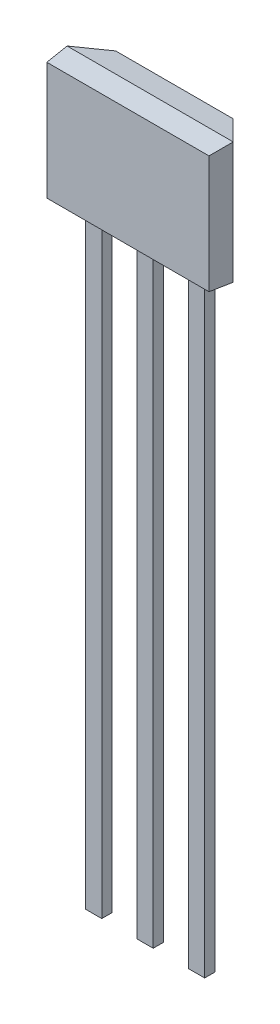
ISO-10303-21;
HEADER;
FILE_DESCRIPTION(('STEP AP214'),'2;1');
FILE_NAME('part.step','',(''),(''),'','','');
FILE_SCHEMA(('AUTOMOTIVE_DESIGN { 1 0 10303 214 1 1 1 1 }'));
ENDSEC;
DATA;
#1=APPLICATION_CONTEXT('core data for automotive mechanical design processes');
#2=APPLICATION_PROTOCOL_DEFINITION('international standard','automotive_design',2000,#1);
#3=PRODUCT_CONTEXT('',#1,'mechanical');
#4=PRODUCT('Part','Part','',(#3));
#5=PRODUCT_RELATED_PRODUCT_CATEGORY('part','',(#4));
#6=PRODUCT_DEFINITION_FORMATION('','',#4);
#7=PRODUCT_DEFINITION_CONTEXT('part definition',#1,'design');
#8=PRODUCT_DEFINITION('design','',#6,#7);
#9=PRODUCT_DEFINITION_SHAPE('','',#8);
#10=(LENGTH_UNIT() NAMED_UNIT(*) SI_UNIT(.MILLI.,.METRE.));
#11=(NAMED_UNIT(*) PLANE_ANGLE_UNIT() SI_UNIT($,.RADIAN.));
#12=(NAMED_UNIT(*) SI_UNIT($,.STERADIAN.) SOLID_ANGLE_UNIT());
#13=UNCERTAINTY_MEASURE_WITH_UNIT(LENGTH_MEASURE(1.E-05),#10,'distance_accuracy_value','');
#14=(GEOMETRIC_REPRESENTATION_CONTEXT(3) GLOBAL_UNCERTAINTY_ASSIGNED_CONTEXT((#13)) GLOBAL_UNIT_ASSIGNED_CONTEXT((#10,
#11,#12)) REPRESENTATION_CONTEXT('',''));
#15=CARTESIAN_POINT('',(0.,0.,0.));
#16=DIRECTION('',(0.,0.,1.));
#17=DIRECTION('',(1.,0.,0.));
#18=AXIS2_PLACEMENT_3D('',#15,#16,#17);
#19=CARTESIAN_POINT('',(0.,0.79,0.51));
#20=DIRECTION('',(0.,0.,-1.));
#21=DIRECTION('',(-1.,0.,0.));
#22=AXIS2_PLACEMENT_3D('',#19,#20,#21);
#23=CYLINDRICAL_SURFACE('',#22,0.15);
#24=CARTESIAN_POINT('',(0.,0.79,0.51));
#25=DIRECTION('',(0.,0.,1.));
#26=DIRECTION('',(1.,0.,0.));
#27=AXIS2_PLACEMENT_3D('',#24,#25,#26);
#28=CIRCLE('',#27,0.15);
#29=CARTESIAN_POINT('',(0.15,0.79,0.51));
#30=VERTEX_POINT('',#29);
#31=EDGE_CURVE('E12',#30,#30,#28,.T.);
#32=ORIENTED_EDGE('',*,*,#31,.F.);
#33=EDGE_LOOP('',(#32));
#34=FACE_BOUND('',#33,.T.);
#35=CARTESIAN_POINT('',(0.,0.79,0.41));
#36=DIRECTION('',(0.,0.,1.));
#37=DIRECTION('',(1.,0.,0.));
#38=AXIS2_PLACEMENT_3D('',#35,#36,#37);
#39=CIRCLE('',#38,0.15);
#40=CARTESIAN_POINT('',(0.15,0.79,0.41));
#41=VERTEX_POINT('',#40);
#42=EDGE_CURVE('E121',#41,#41,#39,.T.);
#43=ORIENTED_EDGE('',*,*,#42,.T.);
#44=EDGE_LOOP('',(#43));
#45=FACE_BOUND('',#44,.T.);
#46=ADVANCED_FACE('F118',(#34,#45),#23,.T.);
#47=CARTESIAN_POINT('',(0.,0.79,0.51));
#48=DIRECTION('',(0.,0.,1.));
#49=DIRECTION('',(1.,0.,0.));
#50=AXIS2_PLACEMENT_3D('',#47,#48,#49);
#51=PLANE('',#50);
#52=ORIENTED_EDGE('',*,*,#31,.T.);
#53=EDGE_LOOP('',(#52));
#54=FACE_BOUND('',#53,.T.);
#55=ADVANCED_FACE('F133',(#54),#51,.T.);
#56=CARTESIAN_POINT('',(0.,0.79,0.41));
#57=DIRECTION('',(0.,0.,1.));
#58=DIRECTION('',(1.,0.,0.));
#59=AXIS2_PLACEMENT_3D('',#56,#57,#58);
#60=PLANE('',#59);
#61=ORIENTED_EDGE('',*,*,#42,.F.);
#62=EDGE_LOOP('',(#61));
#63=FACE_BOUND('',#62,.T.);
#64=ADVANCED_FACE('F131',(#63),#60,.F.);
#65=CLOSED_SHELL('',(#46,#55,#64));
#66=MANIFOLD_SOLID_BREP('B2',#65);
#67=CARTESIAN_POINT('',(1.47,-1.4,0.475));
#68=DIRECTION('',(1.,0.,0.));
#69=DIRECTION('',(0.,0.,-1.));
#70=AXIS2_PLACEMENT_3D('',#67,#68,#69);
#71=PLANE('',#70);
#72=DIRECTION('',(0.,0.,1.));
#73=VECTOR('',#72,1.);
#74=CARTESIAN_POINT('',(1.47,-1.4,0.475));
#75=LINE('',#74,#73);
#76=CARTESIAN_POINT('',(1.47,-1.4,0.475));
#77=VERTEX_POINT('',#76);
#78=CARTESIAN_POINT('',(1.47,-1.4,0.725));
#79=VERTEX_POINT('',#78);
#80=EDGE_CURVE('E190',#77,#79,#75,.T.);
#81=ORIENTED_EDGE('',*,*,#80,.T.);
#82=DIRECTION('',(0.,1.,0.));
#83=VECTOR('',#82,1.);
#84=CARTESIAN_POINT('',(1.47,-1.4,0.725));
#85=LINE('',#84,#83);
#86=CARTESIAN_POINT('',(1.47,-16.6,0.725));
#87=VERTEX_POINT('',#86);
#88=EDGE_CURVE('E116',#87,#79,#85,.T.);
#89=ORIENTED_EDGE('',*,*,#88,.F.);
#90=DIRECTION('',(0.,0.,1.));
#91=VECTOR('',#90,1.);
#92=CARTESIAN_POINT('',(1.47,-16.6,0.475));
#93=LINE('',#92,#91);
#94=CARTESIAN_POINT('',(1.47,-16.6,0.475));
#95=VERTEX_POINT('',#94);
#96=EDGE_CURVE('E214',#95,#87,#93,.T.);
#97=ORIENTED_EDGE('',*,*,#96,.F.);
#98=DIRECTION('',(0.,1.,0.));
#99=VECTOR('',#98,1.);
#100=CARTESIAN_POINT('',(1.47,-1.4,0.475));
#101=LINE('',#100,#99);
#102=EDGE_CURVE('E216',#95,#77,#101,.T.);
#103=ORIENTED_EDGE('',*,*,#102,.T.);
#104=EDGE_LOOP('',(#81,#89,#97,#103));
#105=FACE_BOUND('',#104,.T.);
#106=ADVANCED_FACE('F175',(#105),#71,.T.);
#107=CARTESIAN_POINT('',(1.07,-16.6,0.475));
#108=DIRECTION('',(0.,-1.,0.));
#109=DIRECTION('',(0.,0.,-1.));
#110=AXIS2_PLACEMENT_3D('',#107,#108,#109);
#111=PLANE('',#110);
#112=ORIENTED_EDGE('',*,*,#96,.T.);
#113=DIRECTION('',(1.,0.,0.));
#114=VECTOR('',#113,1.);
#115=CARTESIAN_POINT('',(1.07,-16.6,0.725));
#116=LINE('',#115,#114);
#117=CARTESIAN_POINT('',(1.07,-16.6,0.725));
#118=VERTEX_POINT('',#117);
#119=EDGE_CURVE('E230',#118,#87,#116,.T.);
#120=ORIENTED_EDGE('',*,*,#119,.F.);
#121=DIRECTION('',(0.,0.,1.));
#122=VECTOR('',#121,1.);
#123=CARTESIAN_POINT('',(1.07,-16.6,0.475));
#124=LINE('',#123,#122);
#125=CARTESIAN_POINT('',(1.07,-16.6,0.475));
#126=VERTEX_POINT('',#125);
#127=EDGE_CURVE('E221',#126,#118,#124,.T.);
#128=ORIENTED_EDGE('',*,*,#127,.F.);
#129=DIRECTION('',(1.,0.,0.));
#130=VECTOR('',#129,1.);
#131=CARTESIAN_POINT('',(1.07,-16.6,0.475));
#132=LINE('',#131,#130);
#133=EDGE_CURVE('E228',#126,#95,#132,.T.);
#134=ORIENTED_EDGE('',*,*,#133,.T.);
#135=EDGE_LOOP('',(#112,#120,#128,#134));
#136=FACE_BOUND('',#135,.T.);
#137=ADVANCED_FACE('F232',(#136),#111,.T.);
#138=CARTESIAN_POINT('',(1.07,-1.4,0.475));
#139=DIRECTION('',(-1.,0.,0.));
#140=DIRECTION('',(0.,-1.,0.));
#141=AXIS2_PLACEMENT_3D('',#138,#139,#140);
#142=PLANE('',#141);
#143=ORIENTED_EDGE('',*,*,#127,.T.);
#144=DIRECTION('',(0.,-1.,0.));
#145=VECTOR('',#144,1.);
#146=CARTESIAN_POINT('',(1.07,-1.4,0.725));
#147=LINE('',#146,#145);
#148=CARTESIAN_POINT('',(1.07,-1.4,0.725));
#149=VERTEX_POINT('',#148);
#150=EDGE_CURVE('E242',#149,#118,#147,.T.);
#151=ORIENTED_EDGE('',*,*,#150,.F.);
#152=DIRECTION('',(0.,0.,1.));
#153=VECTOR('',#152,1.);
#154=CARTESIAN_POINT('',(1.07,-1.4,0.475));
#155=LINE('',#154,#153);
#156=CARTESIAN_POINT('',(1.07,-1.4,0.475));
#157=VERTEX_POINT('',#156);
#158=EDGE_CURVE('E197',#157,#149,#155,.T.);
#159=ORIENTED_EDGE('',*,*,#158,.F.);
#160=DIRECTION('',(0.,-1.,0.));
#161=VECTOR('',#160,1.);
#162=CARTESIAN_POINT('',(1.07,-1.4,0.475));
#163=LINE('',#162,#161);
#164=EDGE_CURVE('E234',#157,#126,#163,.T.);
#165=ORIENTED_EDGE('',*,*,#164,.T.);
#166=EDGE_LOOP('',(#143,#151,#159,#165));
#167=FACE_BOUND('',#166,.T.);
#168=ADVANCED_FACE('F247',(#167),#142,.T.);
#169=CARTESIAN_POINT('',(1.07,-1.4,0.475));
#170=DIRECTION('',(0.,1.,0.));
#171=DIRECTION('',(0.,0.,1.));
#172=AXIS2_PLACEMENT_3D('',#169,#170,#171);
#173=PLANE('',#172);
#174=ORIENTED_EDGE('',*,*,#158,.T.);
#175=DIRECTION('',(-1.,0.,0.));
#176=VECTOR('',#175,1.);
#177=CARTESIAN_POINT('',(1.07,-1.4,0.725));
#178=LINE('',#177,#176);
#179=EDGE_CURVE('E183',#79,#149,#178,.T.);
#180=ORIENTED_EDGE('',*,*,#179,.F.);
#181=ORIENTED_EDGE('',*,*,#80,.F.);
#182=DIRECTION('',(-1.,0.,0.));
#183=VECTOR('',#182,1.);
#184=CARTESIAN_POINT('',(1.07,-1.4,0.475));
#185=LINE('',#184,#183);
#186=EDGE_CURVE('E229',#77,#157,#185,.T.);
#187=ORIENTED_EDGE('',*,*,#186,.T.);
#188=EDGE_LOOP('',(#174,#180,#181,#187));
#189=FACE_BOUND('',#188,.T.);
#190=ADVANCED_FACE('F249',(#189),#173,.T.);
#191=CARTESIAN_POINT('',(0.,0.,0.475));
#192=DIRECTION('',(0.,0.,1.));
#193=DIRECTION('',(1.,0.,0.));
#194=AXIS2_PLACEMENT_3D('',#191,#192,#193);
#195=PLANE('',#194);
#196=ORIENTED_EDGE('',*,*,#102,.F.);
#197=ORIENTED_EDGE('',*,*,#133,.F.);
#198=ORIENTED_EDGE('',*,*,#164,.F.);
#199=ORIENTED_EDGE('',*,*,#186,.F.);
#200=EDGE_LOOP('',(#196,#197,#198,#199));
#201=FACE_BOUND('',#200,.T.);
#202=ADVANCED_FACE('F226',(#201),#195,.F.);
#203=CARTESIAN_POINT('',(0.,0.,0.725));
#204=DIRECTION('',(0.,0.,1.));
#205=DIRECTION('',(1.,0.,0.));
#206=AXIS2_PLACEMENT_3D('',#203,#204,#205);
#207=PLANE('',#206);
#208=ORIENTED_EDGE('',*,*,#88,.T.);
#209=ORIENTED_EDGE('',*,*,#179,.T.);
#210=ORIENTED_EDGE('',*,*,#150,.T.);
#211=ORIENTED_EDGE('',*,*,#119,.T.);
#212=EDGE_LOOP('',(#208,#209,#210,#211));
#213=FACE_BOUND('',#212,.T.);
#214=ADVANCED_FACE('F177',(#213),#207,.T.);
#215=CLOSED_SHELL('',(#106,#137,#168,#190,#202,#214));
#216=MANIFOLD_SOLID_BREP('B7',#215);
#217=CARTESIAN_POINT('',(0.2,-1.4,0.475));
#218=DIRECTION('',(1.,0.,0.));
#219=DIRECTION('',(0.,1.,0.));
#220=AXIS2_PLACEMENT_3D('',#217,#218,#219);
#221=PLANE('',#220);
#222=DIRECTION('',(0.,0.,1.));
#223=VECTOR('',#222,1.);
#224=CARTESIAN_POINT('',(0.2,-1.4,0.475));
#225=LINE('',#224,#223);
#226=CARTESIAN_POINT('',(0.2,-1.4,0.475));
#227=VERTEX_POINT('',#226);
#228=CARTESIAN_POINT('',(0.2,-1.4,0.725));
#229=VERTEX_POINT('',#228);
#230=EDGE_CURVE('E336',#227,#229,#225,.T.);
#231=ORIENTED_EDGE('',*,*,#230,.T.);
#232=DIRECTION('',(0.,1.,0.));
#233=VECTOR('',#232,1.);
#234=CARTESIAN_POINT('',(0.2,-1.4,0.725));
#235=LINE('',#234,#233);
#236=CARTESIAN_POINT('',(0.200000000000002,-16.6,0.725));
#237=VERTEX_POINT('',#236);
#238=EDGE_CURVE('E173',#237,#229,#235,.T.);
#239=ORIENTED_EDGE('',*,*,#238,.F.);
#240=DIRECTION('',(0.,0.,1.));
#241=VECTOR('',#240,1.);
#242=CARTESIAN_POINT('',(0.200000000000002,-16.6,0.475));
#243=LINE('',#242,#241);
#244=CARTESIAN_POINT('',(0.200000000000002,-16.6,0.475));
#245=VERTEX_POINT('',#244);
#246=EDGE_CURVE('E360',#245,#237,#243,.T.);
#247=ORIENTED_EDGE('',*,*,#246,.F.);
#248=DIRECTION('',(0.,1.,0.));
#249=VECTOR('',#248,1.);
#250=CARTESIAN_POINT('',(0.2,-1.4,0.475));
#251=LINE('',#250,#249);
#252=EDGE_CURVE('E362',#245,#227,#251,.T.);
#253=ORIENTED_EDGE('',*,*,#252,.T.);
#254=EDGE_LOOP('',(#231,#239,#247,#253));
#255=FACE_BOUND('',#254,.T.);
#256=ADVANCED_FACE('F321',(#255),#221,.T.);
#257=CARTESIAN_POINT('',(-0.199999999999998,-16.6,0.475));
#258=DIRECTION('',(0.,-1.,0.));
#259=DIRECTION('',(1.,0.,0.));
#260=AXIS2_PLACEMENT_3D('',#257,#258,#259);
#261=PLANE('',#260);
#262=ORIENTED_EDGE('',*,*,#246,.T.);
#263=DIRECTION('',(1.,0.,0.));
#264=VECTOR('',#263,1.);
#265=CARTESIAN_POINT('',(-0.199999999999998,-16.6,0.725));
#266=LINE('',#265,#264);
#267=CARTESIAN_POINT('',(-0.199999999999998,-16.6,0.725));
#268=VERTEX_POINT('',#267);
#269=EDGE_CURVE('E376',#268,#237,#266,.T.);
#270=ORIENTED_EDGE('',*,*,#269,.F.);
#271=DIRECTION('',(0.,0.,1.));
#272=VECTOR('',#271,1.);
#273=CARTESIAN_POINT('',(-0.199999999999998,-16.6,0.475));
#274=LINE('',#273,#272);
#275=CARTESIAN_POINT('',(-0.199999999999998,-16.6,0.475));
#276=VERTEX_POINT('',#275);
#277=EDGE_CURVE('E367',#276,#268,#274,.T.);
#278=ORIENTED_EDGE('',*,*,#277,.F.);
#279=DIRECTION('',(1.,0.,0.));
#280=VECTOR('',#279,1.);
#281=CARTESIAN_POINT('',(-0.199999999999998,-16.6,0.475));
#282=LINE('',#281,#280);
#283=EDGE_CURVE('E374',#276,#245,#282,.T.);
#284=ORIENTED_EDGE('',*,*,#283,.T.);
#285=EDGE_LOOP('',(#262,#270,#278,#284));
#286=FACE_BOUND('',#285,.T.);
#287=ADVANCED_FACE('F378',(#286),#261,.T.);
#288=CARTESIAN_POINT('',(-0.2,-1.4,0.475));
#289=DIRECTION('',(-1.,0.,0.));
#290=DIRECTION('',(0.,-1.,0.));
#291=AXIS2_PLACEMENT_3D('',#288,#289,#290);
#292=PLANE('',#291);
#293=ORIENTED_EDGE('',*,*,#277,.T.);
#294=DIRECTION('',(0.,-1.,0.));
#295=VECTOR('',#294,1.);
#296=CARTESIAN_POINT('',(-0.2,-1.4,0.725));
#297=LINE('',#296,#295);
#298=CARTESIAN_POINT('',(-0.2,-1.4,0.725));
#299=VERTEX_POINT('',#298);
#300=EDGE_CURVE('E388',#299,#268,#297,.T.);
#301=ORIENTED_EDGE('',*,*,#300,.F.);
#302=DIRECTION('',(0.,0.,1.));
#303=VECTOR('',#302,1.);
#304=CARTESIAN_POINT('',(-0.2,-1.4,0.475));
#305=LINE('',#304,#303);
#306=CARTESIAN_POINT('',(-0.2,-1.4,0.475));
#307=VERTEX_POINT('',#306);
#308=EDGE_CURVE('E343',#307,#299,#305,.T.);
#309=ORIENTED_EDGE('',*,*,#308,.F.);
#310=DIRECTION('',(0.,-1.,0.));
#311=VECTOR('',#310,1.);
#312=CARTESIAN_POINT('',(-0.2,-1.4,0.475));
#313=LINE('',#312,#311);
#314=EDGE_CURVE('E380',#307,#276,#313,.T.);
#315=ORIENTED_EDGE('',*,*,#314,.T.);
#316=EDGE_LOOP('',(#293,#301,#309,#315));
#317=FACE_BOUND('',#316,.T.);
#318=ADVANCED_FACE('F393',(#317),#292,.T.);
#319=CARTESIAN_POINT('',(-0.2,-1.4,0.475));
#320=DIRECTION('',(0.,1.,0.));
#321=DIRECTION('',(-1.,0.,0.));
#322=AXIS2_PLACEMENT_3D('',#319,#320,#321);
#323=PLANE('',#322);
#324=ORIENTED_EDGE('',*,*,#308,.T.);
#325=DIRECTION('',(-1.,0.,0.));
#326=VECTOR('',#325,1.);
#327=CARTESIAN_POINT('',(-0.2,-1.4,0.725));
#328=LINE('',#327,#326);
#329=EDGE_CURVE('E329',#229,#299,#328,.T.);
#330=ORIENTED_EDGE('',*,*,#329,.F.);
#331=ORIENTED_EDGE('',*,*,#230,.F.);
#332=DIRECTION('',(-1.,0.,0.));
#333=VECTOR('',#332,1.);
#334=CARTESIAN_POINT('',(-0.2,-1.4,0.475));
#335=LINE('',#334,#333);
#336=EDGE_CURVE('E375',#227,#307,#335,.T.);
#337=ORIENTED_EDGE('',*,*,#336,.T.);
#338=EDGE_LOOP('',(#324,#330,#331,#337));
#339=FACE_BOUND('',#338,.T.);
#340=ADVANCED_FACE('F395',(#339),#323,.T.);
#341=CARTESIAN_POINT('',(0.,0.,0.475));
#342=DIRECTION('',(0.,0.,1.));
#343=DIRECTION('',(1.,0.,0.));
#344=AXIS2_PLACEMENT_3D('',#341,#342,#343);
#345=PLANE('',#344);
#346=ORIENTED_EDGE('',*,*,#252,.F.);
#347=ORIENTED_EDGE('',*,*,#283,.F.);
#348=ORIENTED_EDGE('',*,*,#314,.F.);
#349=ORIENTED_EDGE('',*,*,#336,.F.);
#350=EDGE_LOOP('',(#346,#347,#348,#349));
#351=FACE_BOUND('',#350,.T.);
#352=ADVANCED_FACE('F372',(#351),#345,.F.);
#353=CARTESIAN_POINT('',(0.,0.,0.725));
#354=DIRECTION('',(0.,0.,1.));
#355=DIRECTION('',(1.,0.,0.));
#356=AXIS2_PLACEMENT_3D('',#353,#354,#355);
#357=PLANE('',#356);
#358=ORIENTED_EDGE('',*,*,#238,.T.);
#359=ORIENTED_EDGE('',*,*,#329,.T.);
#360=ORIENTED_EDGE('',*,*,#300,.T.);
#361=ORIENTED_EDGE('',*,*,#269,.T.);
#362=EDGE_LOOP('',(#358,#359,#360,#361));
#363=FACE_BOUND('',#362,.T.);
#364=ADVANCED_FACE('F323',(#363),#357,.T.);
#365=CLOSED_SHELL('',(#256,#287,#318,#340,#352,#364));
#366=MANIFOLD_SOLID_BREP('B110',#365);
#367=CARTESIAN_POINT('',(-1.07,-1.4,0.475));
#368=DIRECTION('',(1.,0.,0.));
#369=DIRECTION('',(0.,1.,0.));
#370=AXIS2_PLACEMENT_3D('',#367,#368,#369);
#371=PLANE('',#370);
#372=DIRECTION('',(0.,0.,1.));
#373=VECTOR('',#372,1.);
#374=CARTESIAN_POINT('',(-1.07,-1.4,0.475));
#375=LINE('',#374,#373);
#376=CARTESIAN_POINT('',(-1.07,-1.4,0.475));
#377=VERTEX_POINT('',#376);
#378=CARTESIAN_POINT('',(-1.07,-1.4,0.725));
#379=VERTEX_POINT('',#378);
#380=EDGE_CURVE('E469',#377,#379,#375,.T.);
#381=ORIENTED_EDGE('',*,*,#380,.T.);
#382=DIRECTION('',(0.,1.,0.));
#383=VECTOR('',#382,1.);
#384=CARTESIAN_POINT('',(-1.07,-1.4,0.725));
#385=LINE('',#384,#383);
#386=CARTESIAN_POINT('',(-1.07,-16.6,0.725));
#387=VERTEX_POINT('',#386);
#388=EDGE_CURVE('E506',#387,#379,#385,.T.);
#389=ORIENTED_EDGE('',*,*,#388,.F.);
#390=DIRECTION('',(0.,0.,1.));
#391=VECTOR('',#390,1.);
#392=CARTESIAN_POINT('',(-1.07,-16.6,0.475));
#393=LINE('',#392,#391);
#394=CARTESIAN_POINT('',(-1.07,-16.6,0.475));
#395=VERTEX_POINT('',#394);
#396=EDGE_CURVE('E319',#395,#387,#393,.T.);
#397=ORIENTED_EDGE('',*,*,#396,.F.);
#398=DIRECTION('',(0.,1.,0.));
#399=VECTOR('',#398,1.);
#400=CARTESIAN_POINT('',(-1.07,-1.4,0.475));
#401=LINE('',#400,#399);
#402=EDGE_CURVE('E507',#395,#377,#401,.T.);
#403=ORIENTED_EDGE('',*,*,#402,.T.);
#404=EDGE_LOOP('',(#381,#389,#397,#403));
#405=FACE_BOUND('',#404,.T.);
#406=ADVANCED_FACE('F466',(#405),#371,.T.);
#407=CARTESIAN_POINT('',(-1.47,-16.6,0.475));
#408=DIRECTION('',(0.,-1.,0.));
#409=DIRECTION('',(0.,0.,-1.));
#410=AXIS2_PLACEMENT_3D('',#407,#408,#409);
#411=PLANE('',#410);
#412=ORIENTED_EDGE('',*,*,#396,.T.);
#413=DIRECTION('',(1.,0.,0.));
#414=VECTOR('',#413,1.);
#415=CARTESIAN_POINT('',(-1.47,-16.6,0.725));
#416=LINE('',#415,#414);
#417=CARTESIAN_POINT('',(-1.47,-16.6,0.725));
#418=VERTEX_POINT('',#417);
#419=EDGE_CURVE('E523',#418,#387,#416,.T.);
#420=ORIENTED_EDGE('',*,*,#419,.F.);
#421=DIRECTION('',(0.,0.,1.));
#422=VECTOR('',#421,1.);
#423=CARTESIAN_POINT('',(-1.47,-16.6,0.475));
#424=LINE('',#423,#422);
#425=CARTESIAN_POINT('',(-1.47,-16.6,0.475));
#426=VERTEX_POINT('',#425);
#427=EDGE_CURVE('E474',#426,#418,#424,.T.);
#428=ORIENTED_EDGE('',*,*,#427,.F.);
#429=DIRECTION('',(1.,0.,0.));
#430=VECTOR('',#429,1.);
#431=CARTESIAN_POINT('',(-1.47,-16.6,0.475));
#432=LINE('',#431,#430);
#433=EDGE_CURVE('E512',#426,#395,#432,.T.);
#434=ORIENTED_EDGE('',*,*,#433,.T.);
#435=EDGE_LOOP('',(#412,#420,#428,#434));
#436=FACE_BOUND('',#435,.T.);
#437=ADVANCED_FACE('F538',(#436),#411,.T.);
#438=CARTESIAN_POINT('',(-1.47,-1.4,0.475));
#439=DIRECTION('',(-1.,0.,0.));
#440=DIRECTION('',(0.,-1.,0.));
#441=AXIS2_PLACEMENT_3D('',#438,#439,#440);
#442=PLANE('',#441);
#443=ORIENTED_EDGE('',*,*,#427,.T.);
#444=DIRECTION('',(0.,-1.,0.));
#445=VECTOR('',#444,1.);
#446=CARTESIAN_POINT('',(-1.47,-1.4,0.725));
#447=LINE('',#446,#445);
#448=CARTESIAN_POINT('',(-1.47,-1.4,0.725));
#449=VERTEX_POINT('',#448);
#450=EDGE_CURVE('E519',#449,#418,#447,.T.);
#451=ORIENTED_EDGE('',*,*,#450,.F.);
#452=DIRECTION('',(0.,0.,1.));
#453=VECTOR('',#452,1.);
#454=CARTESIAN_POINT('',(-1.47,-1.4,0.475));
#455=LINE('',#454,#453);
#456=CARTESIAN_POINT('',(-1.47,-1.4,0.475));
#457=VERTEX_POINT('',#456);
#458=EDGE_CURVE('E511',#457,#449,#455,.T.);
#459=ORIENTED_EDGE('',*,*,#458,.F.);
#460=DIRECTION('',(0.,-1.,0.));
#461=VECTOR('',#460,1.);
#462=CARTESIAN_POINT('',(-1.47,-1.4,0.475));
#463=LINE('',#462,#461);
#464=EDGE_CURVE('E531',#457,#426,#463,.T.);
#465=ORIENTED_EDGE('',*,*,#464,.T.);
#466=EDGE_LOOP('',(#443,#451,#459,#465));
#467=FACE_BOUND('',#466,.T.);
#468=ADVANCED_FACE('F535',(#467),#442,.T.);
#469=CARTESIAN_POINT('',(-1.47,-1.4,0.475));
#470=DIRECTION('',(0.,1.,0.));
#471=DIRECTION('',(0.,0.,1.));
#472=AXIS2_PLACEMENT_3D('',#469,#470,#471);
#473=PLANE('',#472);
#474=ORIENTED_EDGE('',*,*,#458,.T.);
#475=DIRECTION('',(-1.,0.,0.));
#476=VECTOR('',#475,1.);
#477=CARTESIAN_POINT('',(-1.47,-1.4,0.725));
#478=LINE('',#477,#476);
#479=EDGE_CURVE('E514',#379,#449,#478,.T.);
#480=ORIENTED_EDGE('',*,*,#479,.F.);
#481=ORIENTED_EDGE('',*,*,#380,.F.);
#482=DIRECTION('',(-1.,0.,0.));
#483=VECTOR('',#482,1.);
#484=CARTESIAN_POINT('',(-1.47,-1.4,0.475));
#485=LINE('',#484,#483);
#486=EDGE_CURVE('E529',#377,#457,#485,.T.);
#487=ORIENTED_EDGE('',*,*,#486,.T.);
#488=EDGE_LOOP('',(#474,#480,#481,#487));
#489=FACE_BOUND('',#488,.T.);
#490=ADVANCED_FACE('F515',(#489),#473,.T.);
#491=CARTESIAN_POINT('',(0.,0.,0.475));
#492=DIRECTION('',(0.,0.,1.));
#493=DIRECTION('',(1.,0.,0.));
#494=AXIS2_PLACEMENT_3D('',#491,#492,#493);
#495=PLANE('',#494);
#496=ORIENTED_EDGE('',*,*,#402,.F.);
#497=ORIENTED_EDGE('',*,*,#433,.F.);
#498=ORIENTED_EDGE('',*,*,#464,.F.);
#499=ORIENTED_EDGE('',*,*,#486,.F.);
#500=EDGE_LOOP('',(#496,#497,#498,#499));
#501=FACE_BOUND('',#500,.T.);
#502=ADVANCED_FACE('F540',(#501),#495,.F.);
#503=CARTESIAN_POINT('',(0.,0.,0.725));
#504=DIRECTION('',(0.,0.,1.));
#505=DIRECTION('',(1.,0.,0.));
#506=AXIS2_PLACEMENT_3D('',#503,#504,#505);
#507=PLANE('',#506);
#508=ORIENTED_EDGE('',*,*,#388,.T.);
#509=ORIENTED_EDGE('',*,*,#479,.T.);
#510=ORIENTED_EDGE('',*,*,#450,.T.);
#511=ORIENTED_EDGE('',*,*,#419,.T.);
#512=EDGE_LOOP('',(#508,#509,#510,#511));
#513=FACE_BOUND('',#512,.T.);
#514=ADVANCED_FACE('F522',(#513),#507,.T.);
#515=CLOSED_SHELL('',(#406,#437,#468,#490,#502,#514));
#516=MANIFOLD_SOLID_BREP('B167',#515);
#517=CARTESIAN_POINT('',(0.,0.,0.));
#518=DIRECTION('',(0.,0.,1.));
#519=DIRECTION('',(1.,0.,0.));
#520=AXIS2_PLACEMENT_3D('',#517,#518,#519);
#521=PLANE('',#520);
#522=DIRECTION('',(1.,0.,0.));
#523=VECTOR('',#522,1.);
#524=CARTESIAN_POINT('',(-2.05,-1.39420381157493,0.));
#525=LINE('',#524,#523);
#526=CARTESIAN_POINT('',(-1.45000000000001,-1.39420381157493,0.));
#527=VERTEX_POINT('',#526);
#528=CARTESIAN_POINT('',(1.45000000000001,-1.39420381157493,0.));
#529=VERTEX_POINT('',#528);
#530=EDGE_CURVE('E671',#527,#529,#525,.T.);
#531=ORIENTED_EDGE('',*,*,#530,.F.);
#532=DIRECTION('',(0.,-1.,0.));
#533=VECTOR('',#532,1.);
#534=CARTESIAN_POINT('',(-1.45000000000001,1.5,0.));
#535=LINE('',#534,#533);
#536=CARTESIAN_POINT('',(-1.45000000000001,1.39420381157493,0.));
#537=VERTEX_POINT('',#536);
#538=EDGE_CURVE('E670',#537,#527,#535,.T.);
#539=ORIENTED_EDGE('',*,*,#538,.F.);
#540=DIRECTION('',(1.,0.,0.));
#541=VECTOR('',#540,1.);
#542=CARTESIAN_POINT('',(-2.05,1.39420381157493,0.));
#543=LINE('',#542,#541);
#544=CARTESIAN_POINT('',(1.45000000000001,1.39420381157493,0.));
#545=VERTEX_POINT('',#544);
#546=EDGE_CURVE('E710',#537,#545,#543,.T.);
#547=ORIENTED_EDGE('',*,*,#546,.T.);
#548=DIRECTION('',(0.,-1.,0.));
#549=VECTOR('',#548,1.);
#550=CARTESIAN_POINT('',(1.45000000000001,1.5,0.));
#551=LINE('',#550,#549);
#552=EDGE_CURVE('E686',#545,#529,#551,.T.);
#553=ORIENTED_EDGE('',*,*,#552,.T.);
#554=EDGE_LOOP('',(#531,#539,#547,#553));
#555=FACE_BOUND('',#554,.T.);
#556=ADVANCED_FACE('F602',(#555),#521,.F.);
#557=CARTESIAN_POINT('',(0.725000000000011,1.5,-0.725000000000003));
#558=DIRECTION('',(-0.707106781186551,0.,0.707106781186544));
#559=DIRECTION('',(0.707106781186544,0.,0.707106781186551));
#560=AXIS2_PLACEMENT_3D('',#557,#558,#559);
#561=PLANE('',#560);
#562=DIRECTION('',(0.70167384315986,-0.123724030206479,0.701673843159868));
#563=VECTOR('',#562,1.);
#564=CARTESIAN_POINT('',(0.484840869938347,-1.22402021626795,-0.96515913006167));
#565=LINE('',#564,#563);
#566=CARTESIAN_POINT('',(2.05,-1.5,0.6));
#567=VERTEX_POINT('',#566);
#568=EDGE_CURVE('E624',#529,#567,#565,.T.);
#569=ORIENTED_EDGE('',*,*,#568,.F.);
#570=ORIENTED_EDGE('',*,*,#552,.F.);
#571=DIRECTION('',(0.70167384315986,0.123724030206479,0.701673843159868));
#572=VECTOR('',#571,1.);
#573=CARTESIAN_POINT('',(0.745282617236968,1.26994312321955,-0.704717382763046));
#574=LINE('',#573,#572);
#575=CARTESIAN_POINT('',(2.05,1.5,0.6));
#576=VERTEX_POINT('',#575);
#577=EDGE_CURVE('E701',#545,#576,#574,.T.);
#578=ORIENTED_EDGE('',*,*,#577,.T.);
#579=DIRECTION('',(0.,-1.,0.));
#580=VECTOR('',#579,1.);
#581=CARTESIAN_POINT('',(2.05,1.5,0.6));
#582=LINE('',#581,#580);
#583=EDGE_CURVE('E680',#576,#567,#582,.T.);
#584=ORIENTED_EDGE('',*,*,#583,.T.);
#585=EDGE_LOOP('',(#569,#570,#578,#584));
#586=FACE_BOUND('',#585,.T.);
#587=ADVANCED_FACE('F714',(#586),#561,.F.);
#588=CARTESIAN_POINT('',(-0.725000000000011,1.5,-0.725000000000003));
#589=DIRECTION('',(-0.707106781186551,0.,-0.707106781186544));
#590=DIRECTION('',(-0.707106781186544,0.,0.707106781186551));
#591=AXIS2_PLACEMENT_3D('',#588,#589,#590);
#592=PLANE('',#591);
#593=ORIENTED_EDGE('',*,*,#538,.T.);
#594=DIRECTION('',(-0.70167384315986,-0.123724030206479,0.701673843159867));
#595=VECTOR('',#594,1.);
#596=CARTESIAN_POINT('',(-0.484840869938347,-1.22402021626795,-0.965159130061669));
#597=LINE('',#596,#595);
#598=CARTESIAN_POINT('',(-2.05,-1.5,0.6));
#599=VERTEX_POINT('',#598);
#600=EDGE_CURVE('E654',#527,#599,#597,.T.);
#601=ORIENTED_EDGE('',*,*,#600,.T.);
#602=DIRECTION('',(0.,-1.,0.));
#603=VECTOR('',#602,1.);
#604=CARTESIAN_POINT('',(-2.05,1.5,0.6));
#605=LINE('',#604,#603);
#606=CARTESIAN_POINT('',(-2.05,1.5,0.6));
#607=VERTEX_POINT('',#606);
#608=EDGE_CURVE('E668',#607,#599,#605,.T.);
#609=ORIENTED_EDGE('',*,*,#608,.F.);
#610=DIRECTION('',(-0.70167384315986,0.123724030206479,0.701673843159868));
#611=VECTOR('',#610,1.);
#612=CARTESIAN_POINT('',(-0.745282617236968,1.26994312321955,-0.704717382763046));
#613=LINE('',#612,#611);
#614=EDGE_CURVE('E705',#537,#607,#613,.T.);
#615=ORIENTED_EDGE('',*,*,#614,.F.);
#616=EDGE_LOOP('',(#593,#601,#609,#615));
#617=FACE_BOUND('',#616,.T.);
#618=ADVANCED_FACE('F665',(#617),#592,.T.);
#619=CARTESIAN_POINT('',(0.,0.,1.15));
#620=DIRECTION('',(0.,0.,1.));
#621=DIRECTION('',(1.,0.,0.));
#622=AXIS2_PLACEMENT_3D('',#619,#620,#621);
#623=PLANE('',#622);
#624=DIRECTION('',(1.,0.,0.));
#625=VECTOR('',#624,1.);
#626=CARTESIAN_POINT('',(-2.05,-1.45188123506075,1.15));
#627=LINE('',#626,#625);
#628=CARTESIAN_POINT('',(-2.00188123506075,-1.45188123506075,1.15));
#629=VERTEX_POINT('',#628);
#630=CARTESIAN_POINT('',(2.00188123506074,-1.45188123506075,1.15));
#631=VERTEX_POINT('',#630);
#632=EDGE_CURVE('E660',#629,#631,#627,.T.);
#633=ORIENTED_EDGE('',*,*,#632,.T.);
#634=DIRECTION('',(0.,-1.,0.));
#635=VECTOR('',#634,1.);
#636=CARTESIAN_POINT('',(2.00188123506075,1.5,1.15));
#637=LINE('',#636,#635);
#638=CARTESIAN_POINT('',(2.00188123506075,1.45188123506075,1.15));
#639=VERTEX_POINT('',#638);
#640=EDGE_CURVE('E695',#639,#631,#637,.T.);
#641=ORIENTED_EDGE('',*,*,#640,.F.);
#642=DIRECTION('',(1.,0.,0.));
#643=VECTOR('',#642,1.);
#644=CARTESIAN_POINT('',(-2.05,1.45188123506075,1.15));
#645=LINE('',#644,#643);
#646=CARTESIAN_POINT('',(-2.00188123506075,1.45188123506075,1.15));
#647=VERTEX_POINT('',#646);
#648=EDGE_CURVE('E616',#647,#639,#645,.T.);
#649=ORIENTED_EDGE('',*,*,#648,.F.);
#650=DIRECTION('',(0.,-1.,0.));
#651=VECTOR('',#650,1.);
#652=CARTESIAN_POINT('',(-2.00188123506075,1.5,1.15));
#653=LINE('',#652,#651);
#654=EDGE_CURVE('E684',#647,#629,#653,.T.);
#655=ORIENTED_EDGE('',*,*,#654,.T.);
#656=EDGE_LOOP('',(#633,#641,#649,#655));
#657=FACE_BOUND('',#656,.T.);
#658=ADVANCED_FACE('F720',(#657),#623,.T.);
#659=CARTESIAN_POINT('',(-2.05,1.5,0.6));
#660=DIRECTION('',(0.996194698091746,0.,-0.0871557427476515));
#661=DIRECTION('',(-0.0871557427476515,0.,-0.996194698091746));
#662=AXIS2_PLACEMENT_3D('',#659,#660,#661);
#663=PLANE('',#662);
#664=ORIENTED_EDGE('',*,*,#608,.T.);
#665=DIRECTION('',(0.086826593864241,0.086826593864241,0.992432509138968));
#666=VECTOR('',#665,1.);
#667=CARTESIAN_POINT('',(-2.0273834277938,-1.4773834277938,0.858508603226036));
#668=LINE('',#667,#666);
#669=EDGE_CURVE('E674',#599,#629,#668,.T.);
#670=ORIENTED_EDGE('',*,*,#669,.T.);
#671=ORIENTED_EDGE('',*,*,#654,.F.);
#672=DIRECTION('',(0.086826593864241,-0.086826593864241,0.992432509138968));
#673=VECTOR('',#672,1.);
#674=CARTESIAN_POINT('',(-2.05,1.5,0.6));
#675=LINE('',#674,#673);
#676=EDGE_CURVE('E659',#607,#647,#675,.T.);
#677=ORIENTED_EDGE('',*,*,#676,.F.);
#678=EDGE_LOOP('',(#664,#670,#671,#677));
#679=FACE_BOUND('',#678,.T.);
#680=ADVANCED_FACE('F683',(#679),#663,.F.);
#681=CARTESIAN_POINT('',(2.05,1.5,0.6));
#682=DIRECTION('',(0.996194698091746,0.,0.0871557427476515));
#683=DIRECTION('',(0.0871557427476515,0.,-0.996194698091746));
#684=AXIS2_PLACEMENT_3D('',#681,#682,#683);
#685=PLANE('',#684);
#686=DIRECTION('',(-0.086826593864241,0.086826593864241,0.992432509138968));
#687=VECTOR('',#686,1.);
#688=CARTESIAN_POINT('',(2.0273834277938,-1.4773834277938,0.858508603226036));
#689=LINE('',#688,#687);
#690=EDGE_CURVE('E464',#567,#631,#689,.T.);
#691=ORIENTED_EDGE('',*,*,#690,.F.);
#692=ORIENTED_EDGE('',*,*,#583,.F.);
#693=DIRECTION('',(-0.086826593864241,-0.086826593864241,0.992432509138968));
#694=VECTOR('',#693,1.);
#695=CARTESIAN_POINT('',(2.05,1.5,0.6));
#696=LINE('',#695,#694);
#697=EDGE_CURVE('E609',#576,#639,#696,.T.);
#698=ORIENTED_EDGE('',*,*,#697,.T.);
#699=ORIENTED_EDGE('',*,*,#640,.T.);
#700=EDGE_LOOP('',(#691,#692,#698,#699));
#701=FACE_BOUND('',#700,.T.);
#702=ADVANCED_FACE('F717',(#701),#685,.T.);
#703=CARTESIAN_POINT('',(-2.05,1.5,0.6));
#704=DIRECTION('',(0.,0.996194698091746,0.0871557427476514));
#705=DIRECTION('',(0.,-0.0871557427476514,0.996194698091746));
#706=AXIS2_PLACEMENT_3D('',#703,#704,#705);
#707=PLANE('',#706);
#708=ORIENTED_EDGE('',*,*,#676,.T.);
#709=ORIENTED_EDGE('',*,*,#648,.T.);
#710=ORIENTED_EDGE('',*,*,#697,.F.);
#711=DIRECTION('',(1.,0.,0.));
#712=VECTOR('',#711,1.);
#713=CARTESIAN_POINT('',(-2.05,1.5,0.6));
#714=LINE('',#713,#712);
#715=EDGE_CURVE('E708',#607,#576,#714,.T.);
#716=ORIENTED_EDGE('',*,*,#715,.F.);
#717=EDGE_LOOP('',(#708,#709,#710,#716));
#718=FACE_BOUND('',#717,.T.);
#719=ADVANCED_FACE('F737',(#718),#707,.T.);
#720=CARTESIAN_POINT('',(-2.05,-1.5,0.6));
#721=DIRECTION('',(0.,0.996194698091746,-0.0871557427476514));
#722=DIRECTION('',(0.,0.0871557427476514,0.996194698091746));
#723=AXIS2_PLACEMENT_3D('',#720,#721,#722);
#724=PLANE('',#723);
#725=DIRECTION('',(1.,0.,0.));
#726=VECTOR('',#725,1.);
#727=CARTESIAN_POINT('',(-2.05,-1.5,0.6));
#728=LINE('',#727,#726);
#729=EDGE_CURVE('E651',#599,#567,#728,.T.);
#730=ORIENTED_EDGE('',*,*,#729,.T.);
#731=ORIENTED_EDGE('',*,*,#690,.T.);
#732=ORIENTED_EDGE('',*,*,#632,.F.);
#733=ORIENTED_EDGE('',*,*,#669,.F.);
#734=EDGE_LOOP('',(#730,#731,#732,#733));
#735=FACE_BOUND('',#734,.T.);
#736=ADVANCED_FACE('F675',(#735),#724,.F.);
#737=CARTESIAN_POINT('',(-2.05,-1.35216342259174,-0.238422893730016));
#738=DIRECTION('',(0.,-0.984807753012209,-0.173648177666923));
#739=DIRECTION('',(0.,0.173648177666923,-0.984807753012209));
#740=AXIS2_PLACEMENT_3D('',#737,#738,#739);
#741=PLANE('',#740);
#742=ORIENTED_EDGE('',*,*,#568,.T.);
#743=ORIENTED_EDGE('',*,*,#729,.F.);
#744=ORIENTED_EDGE('',*,*,#600,.F.);
#745=ORIENTED_EDGE('',*,*,#530,.T.);
#746=EDGE_LOOP('',(#742,#743,#744,#745));
#747=FACE_BOUND('',#746,.T.);
#748=ADVANCED_FACE('F653',(#747),#741,.T.);
#749=CARTESIAN_POINT('',(-2.05,1.5,0.6));
#750=DIRECTION('',(0.,-0.984807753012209,0.173648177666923));
#751=DIRECTION('',(0.,-0.173648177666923,-0.984807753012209));
#752=AXIS2_PLACEMENT_3D('',#749,#750,#751);
#753=PLANE('',#752);
#754=ORIENTED_EDGE('',*,*,#546,.F.);
#755=ORIENTED_EDGE('',*,*,#614,.T.);
#756=ORIENTED_EDGE('',*,*,#715,.T.);
#757=ORIENTED_EDGE('',*,*,#577,.F.);
#758=EDGE_LOOP('',(#754,#755,#756,#757));
#759=FACE_BOUND('',#758,.T.);
#760=ADVANCED_FACE('F743',(#759),#753,.F.);
#761=CLOSED_SHELL('',(#556,#587,#618,#658,#680,#702,#719,#736,#748,#760));
#762=MANIFOLD_SOLID_BREP('B313',#761);
#763=ADVANCED_BREP_SHAPE_REPRESENTATION('',(#18,#66,#216,#366,#516,#762),#14);
#764=SHAPE_DEFINITION_REPRESENTATION(#9,#763);
ENDSEC;
END-ISO-10303-21;
